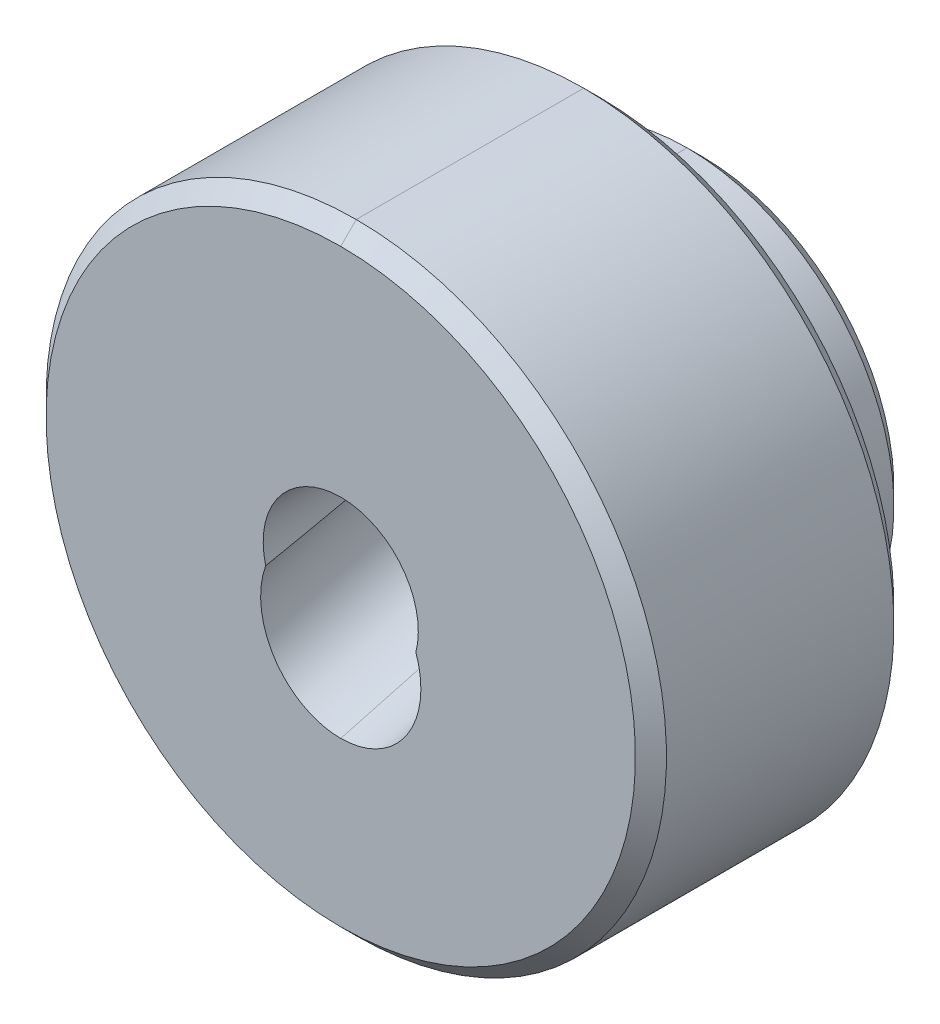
ISO-10303-21;
HEADER;
FILE_DESCRIPTION(('STEP AP214'),'2;1');
FILE_NAME('part.step','',(''),(''),'','','');
FILE_SCHEMA(('AUTOMOTIVE_DESIGN { 1 0 10303 214 1 1 1 1 }'));
ENDSEC;
DATA;
#1=APPLICATION_CONTEXT('core data for automotive mechanical design processes');
#2=APPLICATION_PROTOCOL_DEFINITION('international standard','automotive_design',2000,#1);
#3=PRODUCT_CONTEXT('',#1,'mechanical');
#4=PRODUCT('Part','Part','',(#3));
#5=PRODUCT_RELATED_PRODUCT_CATEGORY('part','',(#4));
#6=PRODUCT_DEFINITION_FORMATION('','',#4);
#7=PRODUCT_DEFINITION_CONTEXT('part definition',#1,'design');
#8=PRODUCT_DEFINITION('design','',#6,#7);
#9=PRODUCT_DEFINITION_SHAPE('','',#8);
#10=(LENGTH_UNIT() NAMED_UNIT(*) SI_UNIT(.MILLI.,.METRE.));
#11=(NAMED_UNIT(*) PLANE_ANGLE_UNIT() SI_UNIT($,.RADIAN.));
#12=(NAMED_UNIT(*) SI_UNIT($,.STERADIAN.) SOLID_ANGLE_UNIT());
#13=UNCERTAINTY_MEASURE_WITH_UNIT(LENGTH_MEASURE(1.E-05),#10,'distance_accuracy_value','');
#14=(GEOMETRIC_REPRESENTATION_CONTEXT(3) GLOBAL_UNCERTAINTY_ASSIGNED_CONTEXT((#13)) GLOBAL_UNIT_ASSIGNED_CONTEXT((#10,
#11,#12)) REPRESENTATION_CONTEXT('',''));
#15=CARTESIAN_POINT('',(0.,0.,0.));
#16=DIRECTION('',(0.,0.,1.));
#17=DIRECTION('',(1.,0.,0.));
#18=AXIS2_PLACEMENT_3D('',#15,#16,#17);
#19=CARTESIAN_POINT('',(0.,0.,3.4));
#20=DIRECTION('',(0.,0.,1.));
#21=DIRECTION('',(1.,0.,0.));
#22=AXIS2_PLACEMENT_3D('',#19,#20,#21);
#23=CYLINDRICAL_SURFACE('',#22,8.);
#24=CARTESIAN_POINT('',(0.,0.,3.4));
#25=DIRECTION('',(0.,0.,1.));
#26=DIRECTION('',(1.,0.,0.));
#27=AXIS2_PLACEMENT_3D('',#24,#25,#26);
#28=CIRCLE('',#27,8.);
#29=CARTESIAN_POINT('',(-8.,0.,3.4));
#30=VERTEX_POINT('',#29);
#31=CARTESIAN_POINT('',(0.,-8.,3.4));
#32=VERTEX_POINT('',#31);
#33=EDGE_CURVE('E409',#30,#32,#28,.T.);
#34=ORIENTED_EDGE('',*,*,#33,.F.);
#35=CARTESIAN_POINT('',(0.,0.,3.4));
#36=DIRECTION('',(0.,0.,1.));
#37=DIRECTION('',(1.,0.,0.));
#38=AXIS2_PLACEMENT_3D('',#35,#36,#37);
#39=CIRCLE('',#38,8.);
#40=CARTESIAN_POINT('',(0.,8.,3.4));
#41=VERTEX_POINT('',#40);
#42=EDGE_CURVE('E278',#41,#30,#39,.T.);
#43=ORIENTED_EDGE('',*,*,#42,.F.);
#44=DIRECTION('',(0.,0.,1.));
#45=VECTOR('',#44,1.);
#46=CARTESIAN_POINT('',(0.,8.,2.));
#47=LINE('',#46,#45);
#48=CARTESIAN_POINT('',(0.,8.,0.6));
#49=VERTEX_POINT('',#48);
#50=EDGE_CURVE('E115',#49,#41,#47,.T.);
#51=ORIENTED_EDGE('',*,*,#50,.F.);
#52=CARTESIAN_POINT('',(0.,0.,0.6));
#53=DIRECTION('',(0.,0.,-1.));
#54=DIRECTION('',(0.,1.,0.));
#55=AXIS2_PLACEMENT_3D('',#52,#53,#54);
#56=CIRCLE('',#55,8.);
#57=CARTESIAN_POINT('',(0.,-8.,0.6));
#58=VERTEX_POINT('',#57);
#59=EDGE_CURVE('E184',#58,#49,#56,.T.);
#60=ORIENTED_EDGE('',*,*,#59,.F.);
#61=DIRECTION('',(0.,0.,-1.));
#62=VECTOR('',#61,1.);
#63=CARTESIAN_POINT('',(0.,-8.,2.));
#64=LINE('',#63,#62);
#65=EDGE_CURVE('E411',#32,#58,#64,.T.);
#66=ORIENTED_EDGE('',*,*,#65,.F.);
#67=EDGE_LOOP('',(#34,#43,#51,#60,#66));
#68=FACE_BOUND('',#67,.T.);
#69=ADVANCED_FACE('F14',(#68),#23,.T.);
#70=CARTESIAN_POINT('',(0.,0.,3.4));
#71=DIRECTION('',(0.,0.,1.));
#72=DIRECTION('',(1.,0.,0.));
#73=AXIS2_PLACEMENT_3D('',#70,#71,#72);
#74=CYLINDRICAL_SURFACE('',#73,8.);
#75=ORIENTED_EDGE('',*,*,#65,.T.);
#76=CARTESIAN_POINT('',(0.,0.,0.6));
#77=DIRECTION('',(0.,0.,-1.));
#78=DIRECTION('',(0.,1.,0.));
#79=AXIS2_PLACEMENT_3D('',#76,#77,#78);
#80=CIRCLE('',#79,8.);
#81=EDGE_CURVE('E168',#49,#58,#80,.T.);
#82=ORIENTED_EDGE('',*,*,#81,.F.);
#83=ORIENTED_EDGE('',*,*,#50,.T.);
#84=CARTESIAN_POINT('',(0.,0.,3.4));
#85=DIRECTION('',(0.,0.,1.));
#86=DIRECTION('',(1.,0.,0.));
#87=AXIS2_PLACEMENT_3D('',#84,#85,#86);
#88=CIRCLE('',#87,8.);
#89=CARTESIAN_POINT('',(8.,0.,3.4));
#90=VERTEX_POINT('',#89);
#91=EDGE_CURVE('E276',#90,#41,#88,.T.);
#92=ORIENTED_EDGE('',*,*,#91,.F.);
#93=CARTESIAN_POINT('',(0.,0.,3.4));
#94=DIRECTION('',(0.,0.,1.));
#95=DIRECTION('',(1.,0.,0.));
#96=AXIS2_PLACEMENT_3D('',#93,#94,#95);
#97=CIRCLE('',#96,8.);
#98=EDGE_CURVE('E220',#32,#90,#97,.T.);
#99=ORIENTED_EDGE('',*,*,#98,.F.);
#100=EDGE_LOOP('',(#75,#82,#83,#92,#99));
#101=FACE_BOUND('',#100,.T.);
#102=ADVANCED_FACE('F403',(#101),#74,.T.);
#103=CARTESIAN_POINT('',(0.,0.,3.4));
#104=DIRECTION('',(0.,0.,1.));
#105=DIRECTION('',(1.,0.,0.));
#106=AXIS2_PLACEMENT_3D('',#103,#104,#105);
#107=TOROIDAL_SURFACE('',#106,8.6,0.6);
#108=CARTESIAN_POINT('',(8.6,0.,3.4));
#109=DIRECTION('',(0.,-1.,0.));
#110=DIRECTION('',(-1.,0.,0.));
#111=AXIS2_PLACEMENT_3D('',#108,#109,#110);
#112=CIRCLE('',#111,0.6);
#113=CARTESIAN_POINT('',(8.6,0.,4.));
#114=VERTEX_POINT('',#113);
#115=EDGE_CURVE('E219',#114,#90,#112,.T.);
#116=ORIENTED_EDGE('',*,*,#115,.F.);
#117=CARTESIAN_POINT('',(0.,0.,4.));
#118=DIRECTION('',(0.,0.,-1.));
#119=DIRECTION('',(1.,0.,0.));
#120=AXIS2_PLACEMENT_3D('',#117,#118,#119);
#121=CIRCLE('',#120,8.6);
#122=CARTESIAN_POINT('',(-8.6,0.,4.));
#123=VERTEX_POINT('',#122);
#124=EDGE_CURVE('E156',#123,#114,#121,.F.);
#125=ORIENTED_EDGE('',*,*,#124,.F.);
#126=CARTESIAN_POINT('',(-8.6,0.,3.4));
#127=DIRECTION('',(0.,1.,0.));
#128=DIRECTION('',(1.,0.,0.));
#129=AXIS2_PLACEMENT_3D('',#126,#127,#128);
#130=CIRCLE('',#129,0.6);
#131=EDGE_CURVE('E212',#30,#123,#130,.F.);
#132=ORIENTED_EDGE('',*,*,#131,.F.);
#133=ORIENTED_EDGE('',*,*,#33,.T.);
#134=ORIENTED_EDGE('',*,*,#98,.T.);
#135=EDGE_LOOP('',(#116,#125,#132,#133,#134));
#136=FACE_BOUND('',#135,.T.);
#137=ADVANCED_FACE('F197',(#136),#107,.F.);
#138=CARTESIAN_POINT('',(0.,0.,3.4));
#139=DIRECTION('',(0.,0.,1.));
#140=DIRECTION('',(1.,0.,0.));
#141=AXIS2_PLACEMENT_3D('',#138,#139,#140);
#142=TOROIDAL_SURFACE('',#141,8.6,0.6);
#143=ORIENTED_EDGE('',*,*,#91,.T.);
#144=ORIENTED_EDGE('',*,*,#42,.T.);
#145=ORIENTED_EDGE('',*,*,#131,.T.);
#146=CARTESIAN_POINT('',(0.,0.,4.));
#147=DIRECTION('',(0.,0.,-1.));
#148=DIRECTION('',(-1.,0.,0.));
#149=AXIS2_PLACEMENT_3D('',#146,#147,#148);
#150=CIRCLE('',#149,8.6);
#151=CARTESIAN_POINT('',(0.,8.6,4.));
#152=VERTEX_POINT('',#151);
#153=EDGE_CURVE('E162',#152,#123,#150,.F.);
#154=ORIENTED_EDGE('',*,*,#153,.F.);
#155=CARTESIAN_POINT('',(0.,0.,4.));
#156=DIRECTION('',(0.,0.,-1.));
#157=DIRECTION('',(0.,1.,0.));
#158=AXIS2_PLACEMENT_3D('',#155,#156,#157);
#159=CIRCLE('',#158,8.6);
#160=EDGE_CURVE('E151',#114,#152,#159,.F.);
#161=ORIENTED_EDGE('',*,*,#160,.F.);
#162=ORIENTED_EDGE('',*,*,#115,.T.);
#163=EDGE_LOOP('',(#143,#144,#145,#154,#161,#162));
#164=FACE_BOUND('',#163,.T.);
#165=ADVANCED_FACE('F191',(#164),#142,.F.);
#166=CARTESIAN_POINT('',(0.,0.,0.));
#167=DIRECTION('',(0.,0.,1.));
#168=DIRECTION('',(1.,0.,0.));
#169=AXIS2_PLACEMENT_3D('',#166,#167,#168);
#170=CONICAL_SURFACE('',#169,7.4,0.78539816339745);
#171=DIRECTION('',(0.,0.707106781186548,-0.707106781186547));
#172=VECTOR('',#171,1.);
#173=CARTESIAN_POINT('',(0.,-5.65685424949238,-1.74314575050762));
#174=LINE('',#173,#172);
#175=CARTESIAN_POINT('',(0.,-7.4,0.));
#176=VERTEX_POINT('',#175);
#177=EDGE_CURVE('E165',#58,#176,#174,.T.);
#178=ORIENTED_EDGE('',*,*,#177,.F.);
#179=ORIENTED_EDGE('',*,*,#59,.T.);
#180=DIRECTION('',(0.,0.707106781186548,0.707106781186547));
#181=VECTOR('',#180,1.);
#182=CARTESIAN_POINT('',(0.,5.65685424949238,-1.74314575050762));
#183=LINE('',#182,#181);
#184=CARTESIAN_POINT('',(0.,7.4,0.));
#185=VERTEX_POINT('',#184);
#186=EDGE_CURVE('E174',#185,#49,#183,.T.);
#187=ORIENTED_EDGE('',*,*,#186,.F.);
#188=CARTESIAN_POINT('',(0.,0.,0.));
#189=DIRECTION('',(0.,0.,1.));
#190=DIRECTION('',(1.,0.,0.));
#191=AXIS2_PLACEMENT_3D('',#188,#189,#190);
#192=CIRCLE('',#191,7.4);
#193=EDGE_CURVE('E148',#176,#185,#192,.F.);
#194=ORIENTED_EDGE('',*,*,#193,.F.);
#195=EDGE_LOOP('',(#178,#179,#187,#194));
#196=FACE_BOUND('',#195,.T.);
#197=ADVANCED_FACE('F196',(#196),#170,.T.);
#198=CARTESIAN_POINT('',(0.,0.,0.));
#199=DIRECTION('',(0.,0.,1.));
#200=DIRECTION('',(1.,0.,0.));
#201=AXIS2_PLACEMENT_3D('',#198,#199,#200);
#202=CONICAL_SURFACE('',#201,7.4,0.78539816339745);
#203=ORIENTED_EDGE('',*,*,#177,.T.);
#204=CARTESIAN_POINT('',(0.,0.,0.));
#205=DIRECTION('',(0.,0.,1.));
#206=DIRECTION('',(1.,0.,0.));
#207=AXIS2_PLACEMENT_3D('',#204,#205,#206);
#208=CIRCLE('',#207,7.4);
#209=EDGE_CURVE('E145',#185,#176,#208,.F.);
#210=ORIENTED_EDGE('',*,*,#209,.F.);
#211=ORIENTED_EDGE('',*,*,#186,.T.);
#212=ORIENTED_EDGE('',*,*,#81,.T.);
#213=EDGE_LOOP('',(#203,#210,#211,#212));
#214=FACE_BOUND('',#213,.T.);
#215=ADVANCED_FACE('F238',(#214),#202,.T.);
#216=CARTESIAN_POINT('',(11.5368021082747,11.4,4.));
#217=DIRECTION('',(0.,0.,-1.));
#218=DIRECTION('',(0.,-1.,0.));
#219=AXIS2_PLACEMENT_3D('',#216,#217,#218);
#220=PLANE('',#219);
#221=ORIENTED_EDGE('',*,*,#124,.T.);
#222=ORIENTED_EDGE('',*,*,#160,.T.);
#223=ORIENTED_EDGE('',*,*,#153,.T.);
#224=EDGE_LOOP('',(#221,#222,#223));
#225=FACE_BOUND('',#224,.T.);
#226=CARTESIAN_POINT('',(0.,0.,4.));
#227=DIRECTION('',(0.,0.,1.));
#228=DIRECTION('',(1.,0.,0.));
#229=AXIS2_PLACEMENT_3D('',#226,#227,#228);
#230=CIRCLE('',#229,11.4);
#231=CARTESIAN_POINT('',(0.,11.4,4.));
#232=VERTEX_POINT('',#231);
#233=CARTESIAN_POINT('',(0.,-11.4,4.));
#234=VERTEX_POINT('',#233);
#235=EDGE_CURVE('E140',#232,#234,#230,.T.);
#236=ORIENTED_EDGE('',*,*,#235,.F.);
#237=CARTESIAN_POINT('',(0.,0.,4.));
#238=DIRECTION('',(0.,0.,1.));
#239=DIRECTION('',(1.,0.,0.));
#240=AXIS2_PLACEMENT_3D('',#237,#238,#239);
#241=CIRCLE('',#240,11.4);
#242=EDGE_CURVE('E150',#234,#232,#241,.T.);
#243=ORIENTED_EDGE('',*,*,#242,.F.);
#244=EDGE_LOOP('',(#236,#243));
#245=FACE_BOUND('',#244,.T.);
#246=ADVANCED_FACE('F228',(#225,#245),#220,.T.);
#247=CARTESIAN_POINT('',(0.,0.,4.));
#248=DIRECTION('',(0.,0.,1.));
#249=DIRECTION('',(1.,0.,0.));
#250=AXIS2_PLACEMENT_3D('',#247,#248,#249);
#251=CONICAL_SURFACE('',#250,11.4,0.78539816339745);
#252=DIRECTION('',(0.,-0.707106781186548,0.707106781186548));
#253=VECTOR('',#252,1.);
#254=CARTESIAN_POINT('',(0.,-8.48528137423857,1.08528137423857));
#255=LINE('',#254,#253);
#256=CARTESIAN_POINT('',(0.,-12.,4.6));
#257=VERTEX_POINT('',#256);
#258=EDGE_CURVE('E143',#234,#257,#255,.T.);
#259=ORIENTED_EDGE('',*,*,#258,.F.);
#260=ORIENTED_EDGE('',*,*,#242,.T.);
#261=DIRECTION('',(0.,-0.707106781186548,-0.707106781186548));
#262=VECTOR('',#261,1.);
#263=CARTESIAN_POINT('',(0.,8.48528137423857,1.08528137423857));
#264=LINE('',#263,#262);
#265=CARTESIAN_POINT('',(0.,12.,4.6));
#266=VERTEX_POINT('',#265);
#267=EDGE_CURVE('E144',#266,#232,#264,.T.);
#268=ORIENTED_EDGE('',*,*,#267,.F.);
#269=CARTESIAN_POINT('',(0.,0.,4.6));
#270=DIRECTION('',(0.,0.,1.));
#271=DIRECTION('',(0.,1.,0.));
#272=AXIS2_PLACEMENT_3D('',#269,#270,#271);
#273=CIRCLE('',#272,12.);
#274=EDGE_CURVE('E327',#257,#266,#273,.T.);
#275=ORIENTED_EDGE('',*,*,#274,.F.);
#276=EDGE_LOOP('',(#259,#260,#268,#275));
#277=FACE_BOUND('',#276,.T.);
#278=ADVANCED_FACE('F237',(#277),#251,.T.);
#279=CARTESIAN_POINT('',(7.48880210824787,7.4,0.));
#280=DIRECTION('',(0.,0.,-1.));
#281=DIRECTION('',(0.,-1.,0.));
#282=AXIS2_PLACEMENT_3D('',#279,#280,#281);
#283=PLANE('',#282);
#284=CARTESIAN_POINT('',(0.,0.,0.));
#285=DIRECTION('',(0.,0.,-1.));
#286=DIRECTION('',(-1.,0.,0.));
#287=AXIS2_PLACEMENT_3D('',#284,#285,#286);
#288=CIRCLE('',#287,3.);
#289=CARTESIAN_POINT('',(2.90404079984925,0.752693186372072,0.));
#290=VERTEX_POINT('',#289);
#291=CARTESIAN_POINT('',(-2.90404079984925,0.752693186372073,0.));
#292=VERTEX_POINT('',#291);
#293=EDGE_CURVE('E28',#290,#292,#288,.T.);
#294=ORIENTED_EDGE('',*,*,#293,.F.);
#295=CARTESIAN_POINT('',(0.,1.87564434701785,0.));
#296=DIRECTION('',(0.,0.,-1.));
#297=DIRECTION('',(0.,-1.,0.));
#298=AXIS2_PLACEMENT_3D('',#295,#296,#297);
#299=ELLIPSE('',#298,3.20935615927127,3.1);
#300=CARTESIAN_POINT('',(0.,5.08500050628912,0.));
#301=VERTEX_POINT('',#300);
#302=EDGE_CURVE('E122',#301,#290,#299,.T.);
#303=ORIENTED_EDGE('',*,*,#302,.F.);
#304=CARTESIAN_POINT('',(0.,1.87564434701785,0.));
#305=DIRECTION('',(0.,0.,-1.));
#306=DIRECTION('',(0.,-1.,0.));
#307=AXIS2_PLACEMENT_3D('',#304,#305,#306);
#308=ELLIPSE('',#307,3.20935615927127,3.1);
#309=EDGE_CURVE('E124',#292,#301,#308,.T.);
#310=ORIENTED_EDGE('',*,*,#309,.F.);
#311=EDGE_LOOP('',(#294,#303,#310));
#312=FACE_BOUND('',#311,.T.);
#313=ORIENTED_EDGE('',*,*,#193,.T.);
#314=ORIENTED_EDGE('',*,*,#209,.T.);
#315=EDGE_LOOP('',(#313,#314));
#316=FACE_BOUND('',#315,.T.);
#317=ADVANCED_FACE('F120',(#312,#316),#283,.T.);
#318=CARTESIAN_POINT('',(0.,0.,4.));
#319=DIRECTION('',(0.,0.,1.));
#320=DIRECTION('',(1.,0.,0.));
#321=AXIS2_PLACEMENT_3D('',#318,#319,#320);
#322=CONICAL_SURFACE('',#321,11.4,0.78539816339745);
#323=ORIENTED_EDGE('',*,*,#258,.T.);
#324=CARTESIAN_POINT('',(0.,0.,4.6));
#325=DIRECTION('',(0.,0.,1.));
#326=DIRECTION('',(0.,1.,0.));
#327=AXIS2_PLACEMENT_3D('',#324,#325,#326);
#328=CIRCLE('',#327,12.);
#329=EDGE_CURVE('E303',#266,#257,#328,.T.);
#330=ORIENTED_EDGE('',*,*,#329,.F.);
#331=ORIENTED_EDGE('',*,*,#267,.T.);
#332=ORIENTED_EDGE('',*,*,#235,.T.);
#333=EDGE_LOOP('',(#323,#330,#331,#332));
#334=FACE_BOUND('',#333,.T.);
#335=ADVANCED_FACE('F429',(#334),#322,.T.);
#336=CARTESIAN_POINT('',(0.,0.,13.4));
#337=DIRECTION('',(0.,0.,1.));
#338=DIRECTION('',(1.,0.,0.));
#339=AXIS2_PLACEMENT_3D('',#336,#337,#338);
#340=CYLINDRICAL_SURFACE('',#339,12.);
#341=DIRECTION('',(0.,0.,1.));
#342=VECTOR('',#341,1.);
#343=CARTESIAN_POINT('',(0.,-12.,9.));
#344=LINE('',#343,#342);
#345=CARTESIAN_POINT('',(0.,-12.,13.4));
#346=VERTEX_POINT('',#345);
#347=EDGE_CURVE('E298',#257,#346,#344,.T.);
#348=ORIENTED_EDGE('',*,*,#347,.F.);
#349=ORIENTED_EDGE('',*,*,#274,.T.);
#350=DIRECTION('',(0.,0.,-1.));
#351=VECTOR('',#350,1.);
#352=CARTESIAN_POINT('',(0.,12.,9.));
#353=LINE('',#352,#351);
#354=CARTESIAN_POINT('',(0.,12.,13.4));
#355=VERTEX_POINT('',#354);
#356=EDGE_CURVE('E310',#355,#266,#353,.T.);
#357=ORIENTED_EDGE('',*,*,#356,.F.);
#358=CARTESIAN_POINT('',(0.,0.,13.4));
#359=DIRECTION('',(0.,0.,1.));
#360=DIRECTION('',(0.,1.,0.));
#361=AXIS2_PLACEMENT_3D('',#358,#359,#360);
#362=CIRCLE('',#361,12.);
#363=EDGE_CURVE('E130',#346,#355,#362,.T.);
#364=ORIENTED_EDGE('',*,*,#363,.F.);
#365=EDGE_LOOP('',(#348,#349,#357,#364));
#366=FACE_BOUND('',#365,.T.);
#367=ADVANCED_FACE('F349',(#366),#340,.T.);
#368=CARTESIAN_POINT('',(0.,0.,14.));
#369=DIRECTION('',(0.,0.,-1.));
#370=DIRECTION('',(-1.,0.,0.));
#371=AXIS2_PLACEMENT_3D('',#368,#369,#370);
#372=CONICAL_SURFACE('',#371,11.4,0.785398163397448);
#373=DIRECTION('',(0.,-0.707106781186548,-0.707106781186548));
#374=VECTOR('',#373,1.);
#375=CARTESIAN_POINT('',(0.,-8.48528137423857,16.9147186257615));
#376=LINE('',#375,#374);
#377=CARTESIAN_POINT('',(0.,-11.4,14.));
#378=VERTEX_POINT('',#377);
#379=EDGE_CURVE('E135',#378,#346,#376,.T.);
#380=ORIENTED_EDGE('',*,*,#379,.T.);
#381=ORIENTED_EDGE('',*,*,#363,.T.);
#382=DIRECTION('',(0.,-0.707106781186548,0.707106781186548));
#383=VECTOR('',#382,1.);
#384=CARTESIAN_POINT('',(0.,8.48528137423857,16.9147186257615));
#385=LINE('',#384,#383);
#386=CARTESIAN_POINT('',(0.,11.4,14.));
#387=VERTEX_POINT('',#386);
#388=EDGE_CURVE('E330',#355,#387,#385,.T.);
#389=ORIENTED_EDGE('',*,*,#388,.T.);
#390=CARTESIAN_POINT('',(0.,0.,14.));
#391=DIRECTION('',(0.,0.,-1.));
#392=DIRECTION('',(-1.,0.,0.));
#393=AXIS2_PLACEMENT_3D('',#390,#391,#392);
#394=CIRCLE('',#393,11.4);
#395=EDGE_CURVE('E296',#378,#387,#394,.F.);
#396=ORIENTED_EDGE('',*,*,#395,.F.);
#397=EDGE_LOOP('',(#380,#381,#389,#396));
#398=FACE_BOUND('',#397,.T.);
#399=ADVANCED_FACE('F350',(#398),#372,.T.);
#400=CARTESIAN_POINT('',(0.,2.09073892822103,-0.80274390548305));
#401=DIRECTION('',(0.,-0.25881904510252,0.965925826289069));
#402=DIRECTION('',(0.,-0.965925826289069,-0.25881904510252));
#403=AXIS2_PLACEMENT_3D('',#400,#401,#402);
#404=CYLINDRICAL_SURFACE('',#403,3.1);
#405=CARTESIAN_POINT('',(0.,3.,7.78132782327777));
#406=CARTESIAN_POINT('',(0.0843503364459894,3.00000821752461,7.78133437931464));
#407=CARTESIAN_POINT('',(0.168697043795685,2.99644259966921,7.78130306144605));
#408=CARTESIAN_POINT('',(0.336787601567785,2.98222658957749,7.78121193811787));
#409=CARTESIAN_POINT('',(0.420531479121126,2.97157651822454,7.78115213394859));
#410=CARTESIAN_POINT('',(0.586725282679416,2.94327207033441,7.78105135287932));
#411=CARTESIAN_POINT('',(0.669176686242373,2.92562640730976,7.78101035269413));
#412=CARTESIAN_POINT('',(0.832282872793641,2.88347155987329,7.7810486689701));
#413=CARTESIAN_POINT('',(0.91293768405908,2.85896248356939,7.78112798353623));
#414=CARTESIAN_POINT('',(1.15139799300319,2.77535728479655,7.78174572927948));
#415=CARTESIAN_POINT('',(1.30578887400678,2.70616785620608,7.78266364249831));
#416=CARTESIAN_POINT('',(1.60086548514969,2.54277112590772,7.78735649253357));
#417=CARTESIAN_POINT('',(1.74153930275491,2.44854233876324,7.79113388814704));
#418=CARTESIAN_POINT('',(1.93879522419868,2.29088816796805,7.80164958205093));
#419=CARTESIAN_POINT('',(2.00220978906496,2.2356686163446,7.80595773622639));
#420=CARTESIAN_POINT('',(2.1240692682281,2.12022637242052,7.81693499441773));
#421=CARTESIAN_POINT('',(2.18251653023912,2.06000607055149,7.82360297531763));
#422=CARTESIAN_POINT('',(2.29389318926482,1.93521057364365,7.84027714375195));
#423=CARTESIAN_POINT('',(2.34682922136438,1.87064077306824,7.85027925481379));
#424=CARTESIAN_POINT('',(2.44672487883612,1.73793776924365,7.8750006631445));
#425=CARTESIAN_POINT('',(2.49368923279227,1.66980744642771,7.88971619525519));
#426=CARTESIAN_POINT('',(2.58656661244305,1.52254247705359,7.92796433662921));
#427=CARTESIAN_POINT('',(2.63163593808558,1.44308681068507,7.95236040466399));
#428=CARTESIAN_POINT('',(2.7127533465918,1.2840918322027,8.01270852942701));
#429=CARTESIAN_POINT('',(2.74882667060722,1.20455339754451,8.04862759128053));
#430=CARTESIAN_POINT('',(2.81203942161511,1.04861531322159,8.13544236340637));
#431=CARTESIAN_POINT('',(2.83906585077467,0.972265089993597,8.18651347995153));
#432=CARTESIAN_POINT('',(2.88425699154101,0.828727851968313,8.30325493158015));
#433=CARTESIAN_POINT('',(2.90242595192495,0.76153645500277,8.36891824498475));
#434=CARTESIAN_POINT('',(2.92613544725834,0.662718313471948,8.48282490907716));
#435=CARTESIAN_POINT('',(2.93382817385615,0.627539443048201,8.527679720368));
#436=CARTESIAN_POINT('',(2.94728305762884,0.560959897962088,8.62040488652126));
#437=CARTESIAN_POINT('',(2.95304443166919,0.529560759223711,8.66827645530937));
#438=CARTESIAN_POINT('',(2.96310678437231,0.470016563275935,8.76647185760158));
#439=CARTESIAN_POINT('',(2.96739978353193,0.441889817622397,8.81680744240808));
#440=CARTESIAN_POINT('',(2.97484819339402,0.38858533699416,8.91906639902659));
#441=CARTESIAN_POINT('',(2.97800386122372,0.363406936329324,8.9709894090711));
#442=CARTESIAN_POINT('',(2.98555551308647,0.297135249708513,9.11623084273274));
#443=CARTESIAN_POINT('',(2.98904821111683,0.258635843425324,9.21077331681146));
#444=CARTESIAN_POINT('',(2.99437336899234,0.187083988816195,9.40196634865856));
#445=CARTESIAN_POINT('',(2.9962044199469,0.154036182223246,9.49861862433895));
#446=CARTESIAN_POINT('',(2.99875624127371,0.0918228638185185,9.69341996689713));
#447=CARTESIAN_POINT('',(2.99947434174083,0.0626668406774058,9.79157206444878));
#448=CARTESIAN_POINT('',(3.00011786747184,0.00728557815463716,9.98870822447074));
#449=CARTESIAN_POINT('',(3.00004315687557,-0.0189391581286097,10.0876924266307));
#450=CARTESIAN_POINT('',(2.99893726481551,-0.0946938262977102,10.3868060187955));
#451=CARTESIAN_POINT('',(2.99701340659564,-0.140904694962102,10.5877669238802));
#452=CARTESIAN_POINT('',(2.99163331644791,-0.228026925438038,10.9904512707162));
#453=CARTESIAN_POINT('',(2.98817943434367,-0.2689462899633,11.1921730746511));
#454=CARTESIAN_POINT('',(2.97917249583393,-0.356187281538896,11.6414410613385));
#455=CARTESIAN_POINT('',(2.97332268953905,-0.40166965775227,11.88914344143));
#456=CARTESIAN_POINT('',(2.96012551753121,-0.489505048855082,12.385195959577));
#457=CARTESIAN_POINT('',(2.9527773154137,-0.531856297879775,12.6335463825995));
#458=CARTESIAN_POINT('',(2.93686358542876,-0.613626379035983,13.1256074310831));
#459=CARTESIAN_POINT('',(2.92832518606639,-0.653086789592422,13.3693120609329));
#460=CARTESIAN_POINT('',(2.90996754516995,-0.730509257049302,13.8567478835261));
#461=CARTESIAN_POINT('',(2.90014914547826,-0.768472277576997,14.1004789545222));
#462=CARTESIAN_POINT('',(2.88970618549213,-0.805976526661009,14.3442499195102));
#463=B_SPLINE_CURVE_WITH_KNOTS('',3,(#405,#406,#407,#408,#409,#410,#411,#412,#413,#414,#415,
#416,#417,#418,#419,#420,#421,#422,#423,#424,#425,#426,#427,#428,#429,#430,#431,#432,#433,#434,
#435,#436,#437,#438,#439,#440,#441,#442,#443,#444,#445,#446,#447,#448,#449,#450,#451,#452,#453,
#454,#455,#456,#457,#458,#459,#460,#461,#462),.UNSPECIFIED.,.F.,.F.,(4,2,2,2,2,2,2,2,2,2,2,2,2,
2,2,2,2,2,2,2,2,2,2,2,2,2,2,2,4),(0.,0.252969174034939,0.505926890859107,0.758570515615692,
1.01121016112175,1.51622047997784,2.02166553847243,2.27398739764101,2.52618933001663,
2.77808403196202,3.02977801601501,3.31250740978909,3.59443435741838,3.87976158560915,
4.16495181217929,4.33729097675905,4.50969993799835,4.683031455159,4.85632376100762,
5.16244285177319,5.46882125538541,5.77593351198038,6.0830983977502,6.70158822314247,
7.31913144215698,8.0748220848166,8.83093571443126,9.57200580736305,10.3125909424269),.UNSPECIFIED.);
#464=CARTESIAN_POINT('',(0.,3.,7.78132782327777));
#465=VERTEX_POINT('',#464);
#466=CARTESIAN_POINT('',(2.90404079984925,-0.75269318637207,14.));
#467=VERTEX_POINT('',#466);
#468=EDGE_CURVE('E35',#465,#467,#463,.T.);
#469=ORIENTED_EDGE('',*,*,#468,.F.);
#470=DIRECTION('',(0.,-0.258819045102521,0.965925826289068));
#471=VECTOR('',#470,1.);
#472=CARTESIAN_POINT('',(0.,2.99437006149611,7.80233903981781));
#473=LINE('',#472,#471);
#474=EDGE_CURVE('E129',#301,#465,#473,.T.);
#475=ORIENTED_EDGE('',*,*,#474,.F.);
#476=ORIENTED_EDGE('',*,*,#302,.T.);
#477=CARTESIAN_POINT('',(0.,-3.,6.21867217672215));
#478=CARTESIAN_POINT('',(0.0843503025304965,-3.00000821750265,6.21866562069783));
#479=CARTESIAN_POINT('',(0.168696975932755,-2.99644260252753,6.21869693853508));
#480=CARTESIAN_POINT('',(0.336787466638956,-2.98222660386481,6.21878806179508));
#481=CARTESIAN_POINT('',(0.420531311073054,-2.97157654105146,6.21884786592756));
#482=CARTESIAN_POINT('',(0.586725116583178,-2.94327210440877,6.21894864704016));
#483=CARTESIAN_POINT('',(0.669176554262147,-2.92562643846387,6.21898964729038));
#484=CARTESIAN_POINT('',(0.832282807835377,-2.88347157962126,6.21895133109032));
#485=CARTESIAN_POINT('',(0.912937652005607,-2.85896249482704,6.21887201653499));
#486=CARTESIAN_POINT('',(1.15139809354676,-2.77535724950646,6.21825427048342));
#487=CARTESIAN_POINT('',(1.30578906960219,-2.70616776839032,6.21733635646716));
#488=CARTESIAN_POINT('',(1.60086566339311,-2.54277100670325,6.21264350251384));
#489=CARTESIAN_POINT('',(1.74153938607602,-2.44854227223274,6.20886610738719));
#490=CARTESIAN_POINT('',(1.93879507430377,-2.29088828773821,6.19835042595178));
#491=CARTESIAN_POINT('',(2.00220949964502,-2.23566886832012,6.19404228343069));
#492=CARTESIAN_POINT('',(2.12406872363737,-2.12022691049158,6.18306506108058));
#493=CARTESIAN_POINT('',(2.18251586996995,-2.06000676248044,6.17639710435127));
#494=CARTESIAN_POINT('',(2.29389257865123,-1.93521130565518,6.15972296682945));
#495=CARTESIAN_POINT('',(2.34682875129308,-1.87064137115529,6.14972084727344));
#496=CARTESIAN_POINT('',(2.44672466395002,-1.73793808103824,6.12499940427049));
#497=CARTESIAN_POINT('',(2.49368913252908,-1.66980760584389,6.11028384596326));
#498=CARTESIAN_POINT('',(2.5865669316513,-1.52254197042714,6.07203553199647));
#499=CARTESIAN_POINT('',(2.63163652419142,-1.44308577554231,6.04763927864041));
#500=CARTESIAN_POINT('',(2.71275381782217,-1.28409079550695,5.98729100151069));
#501=CARTESIAN_POINT('',(2.74882687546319,-1.20455289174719,5.95137212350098));
#502=CARTESIAN_POINT('',(2.81203894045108,-1.04861650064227,5.8645583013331));
#503=CARTESIAN_POINT('',(2.8390650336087,-0.972267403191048,5.81348808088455));
#504=CARTESIAN_POINT('',(2.88425643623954,-0.828729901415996,5.69674705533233));
#505=CARTESIAN_POINT('',(2.90242572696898,-0.761537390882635,5.63108282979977));
#506=CARTESIAN_POINT('',(2.92613561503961,-0.662717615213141,5.5171742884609));
#507=CARTESIAN_POINT('',(2.93382846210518,-0.627538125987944,5.47231860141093));
#508=CARTESIAN_POINT('',(2.94728352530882,-0.560957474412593,5.37959158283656));
#509=CARTESIAN_POINT('',(2.95304495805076,-0.529557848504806,5.33171903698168));
#510=CARTESIAN_POINT('',(2.96310719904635,-0.470013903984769,5.23352346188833));
#511=CARTESIAN_POINT('',(2.96740008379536,-0.441887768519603,5.18318876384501));
#512=CARTESIAN_POINT('',(2.97484831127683,-0.388584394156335,5.08093165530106));
#513=CARTESIAN_POINT('',(2.97800391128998,-0.363406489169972,5.02900960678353));
#514=CARTESIAN_POINT('',(2.98555629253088,-0.297128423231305,4.88375420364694));
#515=CARTESIAN_POINT('',(2.98904934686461,-0.258623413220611,4.78919619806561));
#516=CARTESIAN_POINT('',(2.99437481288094,-0.187061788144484,4.59797160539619));
#517=CARTESIAN_POINT('',(2.9962058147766,-0.15400981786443,4.50130329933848));
#518=CARTESIAN_POINT('',(2.99875731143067,-0.0917891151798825,4.30646987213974));
#519=CARTESIAN_POINT('',(2.99947513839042,-0.0626298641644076,4.20830172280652));
#520=CARTESIAN_POINT('',(3.00011800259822,-0.00724259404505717,4.01113338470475));
#521=CARTESIAN_POINT('',(3.00004290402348,0.0189849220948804,3.91213305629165));
#522=CARTESIAN_POINT('',(2.99893587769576,0.0947305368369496,3.61303638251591));
#523=CARTESIAN_POINT('',(2.99701184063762,0.140931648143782,3.41210911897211));
#524=CARTESIAN_POINT('',(2.99163242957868,0.228039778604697,3.00948876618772));
#525=CARTESIAN_POINT('',(2.98817937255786,0.268954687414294,2.80779729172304));
#526=CARTESIAN_POINT('',(2.97975401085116,0.350546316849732,2.38759370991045));
#527=CARTESIAN_POINT('',(2.97468211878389,0.390941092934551,2.16902913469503));
#528=CARTESIAN_POINT('',(2.96335146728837,0.469150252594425,1.73135939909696));
#529=CARTESIAN_POINT('',(2.95709209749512,0.506963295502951,1.51225401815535));
#530=CARTESIAN_POINT('',(2.94360478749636,0.58013219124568,1.07764997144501));
#531=CARTESIAN_POINT('',(2.93639592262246,0.615519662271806,0.862156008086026));
#532=CARTESIAN_POINT('',(2.92096764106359,0.684977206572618,0.431122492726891));
#533=CARTESIAN_POINT('',(2.91274882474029,0.719048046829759,0.215583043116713));
#534=CARTESIAN_POINT('',(2.90404079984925,0.752693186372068,0.));
#535=B_SPLINE_CURVE_WITH_KNOTS('',3,(#477,#478,#479,#480,#481,#482,#483,#484,#485,#486,#487,
#488,#489,#490,#491,#492,#493,#494,#495,#496,#497,#498,#499,#500,#501,#502,#503,#504,#505,#506,
#507,#508,#509,#510,#511,#512,#513,#514,#515,#516,#517,#518,#519,#520,#521,#522,#523,#524,#525,
#526,#527,#528,#529,#530,#531,#532,#533,#534),.UNSPECIFIED.,.F.,.F.,(4,2,2,2,2,2,2,2,2,2,2,2,2,
2,2,2,2,2,2,2,2,2,2,2,2,2,2,2,4),(0.,0.252969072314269,0.505926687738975,0.758570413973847,
1.01121016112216,1.51622079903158,2.02166553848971,2.27398682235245,2.52618818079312,
2.77808345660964,3.02977801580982,3.31250924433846,3.59443435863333,3.87975727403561,
4.16495181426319,4.33729420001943,4.5097064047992,4.68303470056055,4.85632376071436,
5.16249221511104,5.46892012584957,5.77608128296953,6.08329505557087,6.70168017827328,
7.31913142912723,7.98607280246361,8.65335791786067,9.3088485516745,9.96395139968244),.UNSPECIFIED.);
#536=CARTESIAN_POINT('',(0.,-3.,6.21867217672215));
#537=VERTEX_POINT('',#536);
#538=EDGE_CURVE('E108',#537,#290,#535,.T.);
#539=ORIENTED_EDGE('',*,*,#538,.F.);
#540=DIRECTION('',(0.,0.258819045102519,-0.965925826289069));
#541=VECTOR('',#540,1.);
#542=CARTESIAN_POINT('',(0.,-2.99437006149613,6.19766096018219));
#543=LINE('',#542,#541);
#544=CARTESIAN_POINT('',(0.,-5.08500050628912,14.));
#545=VERTEX_POINT('',#544);
#546=EDGE_CURVE('E132',#545,#537,#543,.T.);
#547=ORIENTED_EDGE('',*,*,#546,.F.);
#548=CARTESIAN_POINT('',(0.,-1.87564434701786,14.));
#549=DIRECTION('',(0.,0.,1.));
#550=DIRECTION('',(0.,-1.,0.));
#551=AXIS2_PLACEMENT_3D('',#548,#549,#550);
#552=ELLIPSE('',#551,3.20935615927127,3.1);
#553=EDGE_CURVE('E295',#467,#545,#552,.F.);
#554=ORIENTED_EDGE('',*,*,#553,.F.);
#555=EDGE_LOOP('',(#469,#475,#476,#539,#547,#554));
#556=FACE_BOUND('',#555,.T.);
#557=ADVANCED_FACE('F127',(#556),#404,.F.);
#558=CARTESIAN_POINT('',(0.,2.09073892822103,-0.80274390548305));
#559=DIRECTION('',(0.,-0.25881904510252,0.965925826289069));
#560=DIRECTION('',(0.,-0.965925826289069,-0.25881904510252));
#561=AXIS2_PLACEMENT_3D('',#558,#559,#560);
#562=CYLINDRICAL_SURFACE('',#561,3.1);
#563=CARTESIAN_POINT('',(-2.88970618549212,-0.805976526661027,14.3442499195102));
#564=CARTESIAN_POINT('',(-2.89636253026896,-0.782105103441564,14.1889499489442));
#565=CARTESIAN_POINT('',(-2.90276167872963,-0.758025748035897,14.0336706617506));
#566=CARTESIAN_POINT('',(-2.9150418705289,-0.709339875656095,13.7231711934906));
#567=CARTESIAN_POINT('',(-2.92092290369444,-0.684733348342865,13.5679510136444));
#568=CARTESIAN_POINT('',(-2.93779185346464,-0.609917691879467,13.1021672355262));
#569=CARTESIAN_POINT('',(-2.94799498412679,-0.558750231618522,12.7917283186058));
#570=CARTESIAN_POINT('',(-2.96626670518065,-0.451947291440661,12.1687163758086));
#571=CARTESIAN_POINT('',(-2.97431565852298,-0.396276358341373,11.8561487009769));
#572=CARTESIAN_POINT('',(-2.9843600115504,-0.307359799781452,11.3883314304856));
#573=CARTESIAN_POINT('',(-2.98736961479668,-0.276824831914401,11.2325907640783));
#574=CARTESIAN_POINT('',(-2.9925847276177,-0.213222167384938,10.9216168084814));
#575=CARTESIAN_POINT('',(-2.99479028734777,-0.180154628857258,10.7663834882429));
#576=CARTESIAN_POINT('',(-2.99763509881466,-0.1214471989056,10.5058285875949));
#577=CARTESIAN_POINT('',(-2.99854926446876,-0.0967779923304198,10.4002925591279));
#578=CARTESIAN_POINT('',(-2.99977073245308,-0.0451981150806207,10.1897449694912));
#579=CARTESIAN_POINT('',(-3.000077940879,-0.0182870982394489,10.0847334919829));
#580=CARTESIAN_POINT('',(-2.99988788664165,0.0385372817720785,9.87549641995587));
#581=CARTESIAN_POINT('',(-2.99939051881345,0.068451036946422,9.77127092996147));
#582=CARTESIAN_POINT('',(-2.99724685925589,0.132397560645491,9.56413521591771));
#583=CARTESIAN_POINT('',(-2.9956009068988,0.166429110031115,9.46122461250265));
#584=CARTESIAN_POINT('',(-2.99008460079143,0.24787264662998,9.23647967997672));
#585=CARTESIAN_POINT('',(-2.98582664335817,0.296597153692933,9.11510243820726));
#586=CARTESIAN_POINT('',(-2.97605163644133,0.379292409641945,8.93775071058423));
#587=CARTESIAN_POINT('',(-2.97223218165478,0.408436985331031,8.8794553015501));
#588=CARTESIAN_POINT('',(-2.96301850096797,0.470653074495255,8.76514721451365));
#589=CARTESIAN_POINT('',(-2.95762505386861,0.503722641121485,8.70913342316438));
#590=CARTESIAN_POINT('',(-2.94231376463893,0.587564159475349,8.58027855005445));
#591=CARTESIAN_POINT('',(-2.93146148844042,0.640373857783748,8.5088244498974));
#592=CARTESIAN_POINT('',(-2.9038873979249,0.755585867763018,8.37554484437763));
#593=CARTESIAN_POINT('',(-2.88718249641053,0.817960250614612,8.31369232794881));
#594=CARTESIAN_POINT('',(-2.84602308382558,0.951320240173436,8.2022194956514));
#595=CARTESIAN_POINT('',(-2.82152258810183,1.022355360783,8.15267495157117));
#596=CARTESIAN_POINT('',(-2.76400969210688,1.16895226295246,8.06672908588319));
#597=CARTESIAN_POINT('',(-2.73097534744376,1.2445253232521,8.03036223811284));
#598=CARTESIAN_POINT('',(-2.66958993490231,1.3698035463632,7.97940324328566));
#599=CARTESIAN_POINT('',(-2.64356358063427,1.4194256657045,7.961628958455));
#600=CARTESIAN_POINT('',(-2.58817967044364,1.51806689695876,7.93000186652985));
#601=CARTESIAN_POINT('',(-2.55882094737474,1.56708579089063,7.91615043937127));
#602=CARTESIAN_POINT('',(-2.46590105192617,1.71246397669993,7.87926764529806));
#603=CARTESIAN_POINT('',(-2.397560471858,1.80701184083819,7.86095630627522));
#604=CARTESIAN_POINT('',(-2.27366554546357,1.95875948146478,7.83682492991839));
#605=CARTESIAN_POINT('',(-2.22111249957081,2.01815758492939,7.82888057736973));
#606=CARTESIAN_POINT('',(-2.1112972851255,2.13277308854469,7.81559519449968));
#607=CARTESIAN_POINT('',(-2.0540337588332,2.18798927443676,7.81025491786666));
#608=CARTESIAN_POINT('',(-1.8758453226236,2.34657954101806,7.79697832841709));
#609=CARTESIAN_POINT('',(-1.74841972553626,2.44302128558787,7.79176989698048));
#610=CARTESIAN_POINT('',(-1.47855083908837,2.61530496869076,7.78482828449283));
#611=CARTESIAN_POINT('',(-1.33596932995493,2.69092984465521,7.78313060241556));
#612=CARTESIAN_POINT('',(-1.04053278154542,2.81835665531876,7.78123880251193));
#613=CARTESIAN_POINT('',(-0.887681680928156,2.87016766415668,7.78104411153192));
#614=CARTESIAN_POINT('',(-0.612180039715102,2.93946357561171,7.7810125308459));
#615=CARTESIAN_POINT('',(-0.49080512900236,2.96213721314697,7.7811027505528));
#616=CARTESIAN_POINT('',(-0.246300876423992,2.9924135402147,7.78127512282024));
#617=CARTESIAN_POINT('',(-0.12317319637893,3.00002965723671,7.78135728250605));
#618=CARTESIAN_POINT('',(0.,3.,7.78132782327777));
#619=B_SPLINE_CURVE_WITH_KNOTS('',3,(#563,#564,#565,#566,#567,#568,#569,#570,#571,#572,#573,
#574,#575,#576,#577,#578,#579,#580,#581,#582,#583,#584,#585,#586,#587,#588,#589,#590,#591,#592,
#593,#594,#595,#596,#597,#598,#599,#600,#601,#602,#603,#604,#605,#606,#607,#608,#609,#610,#611,
#612,#613,#614,#615,#616,#617,#618),.UNSPECIFIED.,.F.,.F.,(4,2,2,2,2,2,2,2,2,2,2,2,2,2,2,2,2,2,
2,2,2,2,2,2,2,2,2,4),(0.,0.471794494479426,0.943598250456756,1.88795873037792,2.84065527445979,
3.3168437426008,3.79300250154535,4.1181371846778,4.44332216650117,4.76854965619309,
5.09368109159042,5.48562665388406,5.68134669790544,5.87697006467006,6.14453319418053,
6.41132941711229,6.6797295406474,6.9488268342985,7.1249589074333,7.30115286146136,
7.65400159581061,7.8928650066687,8.13179750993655,8.60917838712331,9.09136316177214,
9.57336405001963,9.94289180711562,10.3120898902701),.UNSPECIFIED.);
#620=CARTESIAN_POINT('',(-2.90404079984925,-0.752693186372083,14.));
#621=VERTEX_POINT('',#620);
#622=EDGE_CURVE('E125',#621,#465,#619,.T.);
#623=ORIENTED_EDGE('',*,*,#622,.F.);
#624=CARTESIAN_POINT('',(0.,-1.87564434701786,14.));
#625=DIRECTION('',(0.,0.,1.));
#626=DIRECTION('',(0.,-1.,0.));
#627=AXIS2_PLACEMENT_3D('',#624,#625,#626);
#628=ELLIPSE('',#627,3.20935615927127,3.1);
#629=EDGE_CURVE('E292',#545,#621,#628,.F.);
#630=ORIENTED_EDGE('',*,*,#629,.F.);
#631=ORIENTED_EDGE('',*,*,#546,.T.);
#632=CARTESIAN_POINT('',(-2.90404079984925,0.752693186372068,0.));
#633=CARTESIAN_POINT('',(-2.91496961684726,0.710385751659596,0.270769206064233));
#634=CARTESIAN_POINT('',(-2.92513960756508,0.667477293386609,0.541486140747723));
#635=CARTESIAN_POINT('',(-2.9438699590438,0.579409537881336,1.08275755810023));
#636=CARTESIAN_POINT('',(-2.95242945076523,0.534249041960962,1.3533118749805));
#637=CARTESIAN_POINT('',(-2.96788033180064,0.440395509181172,1.89550411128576));
#638=CARTESIAN_POINT('',(-2.97476157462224,0.391683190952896,2.16713899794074));
#639=CARTESIAN_POINT('',(-2.98650943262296,0.288940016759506,2.70940742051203));
#640=CARTESIAN_POINT('',(-2.99137657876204,0.234910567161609,2.98004120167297));
#641=CARTESIAN_POINT('',(-2.99625042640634,0.151838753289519,3.36049428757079));
#642=CARTESIAN_POINT('',(-2.99743155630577,0.126816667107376,3.47117043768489));
#643=CARTESIAN_POINT('',(-2.99918800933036,0.0745630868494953,3.69202470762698));
#644=CARTESIAN_POINT('',(-2.99976324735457,0.0473312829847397,3.80220275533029));
#645=CARTESIAN_POINT('',(-3.00012123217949,-0.0100991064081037,4.0218332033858));
#646=CARTESIAN_POINT('',(-2.99990374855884,-0.0402985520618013,4.13128538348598));
#647=CARTESIAN_POINT('',(-2.99834163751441,-0.104795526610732,4.34893527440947));
#648=CARTESIAN_POINT('',(-2.99699732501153,-0.139091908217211,4.45713332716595));
#649=CARTESIAN_POINT('',(-2.99219286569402,-0.221015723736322,4.69328157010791));
#650=CARTESIAN_POINT('',(-2.98835987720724,-0.269936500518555,4.82080225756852));
#651=CARTESIAN_POINT('',(-2.97927343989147,-0.353104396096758,5.00753257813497));
#652=CARTESIAN_POINT('',(-2.97569118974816,-0.382440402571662,5.06898687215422));
#653=CARTESIAN_POINT('',(-2.96695554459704,-0.445176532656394,5.18964942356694));
#654=CARTESIAN_POINT('',(-2.96180295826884,-0.47857455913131,5.24885881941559));
#655=CARTESIAN_POINT('',(-2.94726352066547,-0.562140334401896,5.38311198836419));
#656=CARTESIAN_POINT('',(-2.93704033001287,-0.614204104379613,5.45692905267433));
#657=CARTESIAN_POINT('',(-2.91086198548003,-0.72819623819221,5.59521285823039));
#658=CARTESIAN_POINT('',(-2.89492488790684,-0.790093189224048,5.65970816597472));
#659=CARTESIAN_POINT('',(-2.85523069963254,-0.923298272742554,5.77653638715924));
#660=CARTESIAN_POINT('',(-2.83141302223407,-0.994676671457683,5.82876953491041));
#661=CARTESIAN_POINT('',(-2.77498931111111,-1.14267046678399,5.91949638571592));
#662=CARTESIAN_POINT('',(-2.74236171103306,-1.21929836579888,5.95795582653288));
#663=CARTESIAN_POINT('',(-2.68224812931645,-1.34479362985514,6.01101315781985));
#664=CARTESIAN_POINT('',(-2.65731361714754,-1.39346159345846,6.02917782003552));
#665=CARTESIAN_POINT('',(-2.6042135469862,-1.49034351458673,6.06160064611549));
#666=CARTESIAN_POINT('',(-2.57604698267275,-1.53855732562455,6.07585758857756));
#667=CARTESIAN_POINT('',(-2.4868332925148,-1.68174973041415,6.11393304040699));
#668=CARTESIAN_POINT('',(-2.42113907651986,-1.77513770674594,6.13300217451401));
#669=CARTESIAN_POINT('',(-2.3013208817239,-1.92616368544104,6.15839985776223));
#670=CARTESIAN_POINT('',(-2.25006431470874,-1.98580151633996,6.16684939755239));
#671=CARTESIAN_POINT('',(-2.14283780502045,-2.10105680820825,6.18102294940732));
#672=CARTESIAN_POINT('',(-2.08686644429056,-2.15667305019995,6.1867461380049));
#673=CARTESIAN_POINT('',(-1.91253596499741,-2.31668644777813,6.20102934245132));
#674=CARTESIAN_POINT('',(-1.78766000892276,-2.4143749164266,6.20672046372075));
#675=CARTESIAN_POINT('',(-1.522539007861,-2.58988196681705,6.21440511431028));
#676=CARTESIAN_POINT('',(-1.38213059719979,-2.66745355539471,6.21635440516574));
#677=CARTESIAN_POINT('',(-1.09075866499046,-2.79924734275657,6.21859705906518));
#678=CARTESIAN_POINT('',(-0.939798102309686,-2.8534760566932,6.21889088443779));
#679=CARTESIAN_POINT('',(-0.657600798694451,-2.93004017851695,6.21901481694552));
#680=CARTESIAN_POINT('',(-0.527404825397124,-2.95624334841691,6.21891562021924));
#681=CARTESIAN_POINT('',(-0.330476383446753,-2.9824782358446,6.21878564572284));
#682=CARTESIAN_POINT('',(-0.264563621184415,-2.989044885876,6.21874545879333));
#683=CARTESIAN_POINT('',(-0.132439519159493,-2.99780641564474,6.21868773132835));
#684=CARTESIAN_POINT('',(-0.0662281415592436,-3.00000072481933,6.21867019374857));
#685=CARTESIAN_POINT('',(0.,-3.,6.21867217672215));
#686=B_SPLINE_CURVE_WITH_KNOTS('',3,(#632,#633,#634,#635,#636,#637,#638,#639,#640,#641,#642,
#643,#644,#645,#646,#647,#648,#649,#650,#651,#652,#653,#654,#655,#656,#657,#658,#659,#660,#661,
#662,#663,#664,#665,#666,#667,#668,#669,#670,#671,#672,#673,#674,#675,#676,#677,#678,#679,#680,
#681,#682,#683,#684,#685),.UNSPECIFIED.,.F.,.F.,(4,2,2,2,2,2,2,2,2,2,2,2,2,2,2,2,2,2,2,2,2,2,2,
2,2,2,4),(0.,0.822832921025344,1.6461085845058,2.47424470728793,3.30216237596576,
3.64257104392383,3.98302751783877,4.32358296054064,4.66404325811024,5.0733407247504,
5.27777751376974,5.482109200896,5.75390681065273,6.02485298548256,6.29793259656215,
6.57168685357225,6.74433737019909,6.91704178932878,7.26294165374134,7.49995817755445,
7.73704624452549,8.21074073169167,8.6900018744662,9.16912916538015,9.56633615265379,
9.76492497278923,9.96353970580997),.UNSPECIFIED.);
#687=EDGE_CURVE('E110',#292,#537,#686,.T.);
#688=ORIENTED_EDGE('',*,*,#687,.F.);
#689=ORIENTED_EDGE('',*,*,#309,.T.);
#690=ORIENTED_EDGE('',*,*,#474,.T.);
#691=EDGE_LOOP('',(#623,#630,#631,#688,#689,#690));
#692=FACE_BOUND('',#691,.T.);
#693=ADVANCED_FACE('F363',(#692),#562,.F.);
#694=CARTESIAN_POINT('',(0.,0.,13.4));
#695=DIRECTION('',(0.,0.,1.));
#696=DIRECTION('',(1.,0.,0.));
#697=AXIS2_PLACEMENT_3D('',#694,#695,#696);
#698=CYLINDRICAL_SURFACE('',#697,12.);
#699=ORIENTED_EDGE('',*,*,#347,.T.);
#700=CARTESIAN_POINT('',(0.,0.,13.4));
#701=DIRECTION('',(0.,0.,1.));
#702=DIRECTION('',(0.,1.,0.));
#703=AXIS2_PLACEMENT_3D('',#700,#701,#702);
#704=CIRCLE('',#703,12.);
#705=EDGE_CURVE('E291',#355,#346,#704,.T.);
#706=ORIENTED_EDGE('',*,*,#705,.F.);
#707=ORIENTED_EDGE('',*,*,#356,.T.);
#708=ORIENTED_EDGE('',*,*,#329,.T.);
#709=EDGE_LOOP('',(#699,#706,#707,#708));
#710=FACE_BOUND('',#709,.T.);
#711=ADVANCED_FACE('F348',(#710),#698,.T.);
#712=CARTESIAN_POINT('',(11.536802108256,-11.4,14.));
#713=DIRECTION('',(0.,0.,1.));
#714=DIRECTION('',(0.,1.,0.));
#715=AXIS2_PLACEMENT_3D('',#712,#713,#714);
#716=PLANE('',#715);
#717=CARTESIAN_POINT('',(0.,0.,14.));
#718=DIRECTION('',(0.,0.,1.));
#719=DIRECTION('',(1.,0.,0.));
#720=AXIS2_PLACEMENT_3D('',#717,#718,#719);
#721=CIRCLE('',#720,3.);
#722=EDGE_CURVE('E9',#467,#621,#721,.T.);
#723=ORIENTED_EDGE('',*,*,#722,.F.);
#724=ORIENTED_EDGE('',*,*,#553,.T.);
#725=ORIENTED_EDGE('',*,*,#629,.T.);
#726=EDGE_LOOP('',(#723,#724,#725));
#727=FACE_BOUND('',#726,.T.);
#728=CARTESIAN_POINT('',(0.,0.,14.));
#729=DIRECTION('',(0.,0.,-1.));
#730=DIRECTION('',(-1.,0.,0.));
#731=AXIS2_PLACEMENT_3D('',#728,#729,#730);
#732=CIRCLE('',#731,11.4);
#733=EDGE_CURVE('E21',#378,#387,#732,.T.);
#734=ORIENTED_EDGE('',*,*,#733,.F.);
#735=ORIENTED_EDGE('',*,*,#395,.T.);
#736=EDGE_LOOP('',(#734,#735));
#737=FACE_BOUND('',#736,.T.);
#738=ADVANCED_FACE('F351',(#727,#737),#716,.T.);
#739=CARTESIAN_POINT('',(0.,0.,14.));
#740=DIRECTION('',(0.,0.,-1.));
#741=DIRECTION('',(-1.,0.,0.));
#742=AXIS2_PLACEMENT_3D('',#739,#740,#741);
#743=CONICAL_SURFACE('',#742,11.4,0.785398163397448);
#744=ORIENTED_EDGE('',*,*,#379,.F.);
#745=ORIENTED_EDGE('',*,*,#733,.T.);
#746=ORIENTED_EDGE('',*,*,#388,.F.);
#747=ORIENTED_EDGE('',*,*,#705,.T.);
#748=EDGE_LOOP('',(#744,#745,#746,#747));
#749=FACE_BOUND('',#748,.T.);
#750=ADVANCED_FACE('F347',(#749),#743,.T.);
#751=CARTESIAN_POINT('',(0.,0.,14.3442499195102));
#752=DIRECTION('',(0.,0.,-1.));
#753=DIRECTION('',(-1.,0.,0.));
#754=AXIS2_PLACEMENT_3D('',#751,#752,#753);
#755=CYLINDRICAL_SURFACE('',#754,3.);
#756=ORIENTED_EDGE('',*,*,#468,.T.);
#757=ORIENTED_EDGE('',*,*,#722,.T.);
#758=ORIENTED_EDGE('',*,*,#622,.T.);
#759=EDGE_LOOP('',(#756,#757,#758));
#760=FACE_BOUND('',#759,.T.);
#761=ADVANCED_FACE('F361',(#760),#755,.F.);
#762=ORIENTED_EDGE('',*,*,#538,.T.);
#763=ORIENTED_EDGE('',*,*,#293,.T.);
#764=ORIENTED_EDGE('',*,*,#687,.T.);
#765=EDGE_LOOP('',(#762,#763,#764));
#766=FACE_BOUND('',#765,.T.);
#767=ADVANCED_FACE('F109',(#766),#755,.F.);
#768=CLOSED_SHELL('',(#69,#102,#137,#165,#197,#215,#246,#278,#317,#335,#367,#399,#557,#693,#711,
#738,#750,#761,#767));
#769=MANIFOLD_SOLID_BREP('B1',#768);
#770=ADVANCED_BREP_SHAPE_REPRESENTATION('',(#18,#769),#14);
#771=SHAPE_DEFINITION_REPRESENTATION(#9,#770);
ENDSEC;
END-ISO-10303-21;
